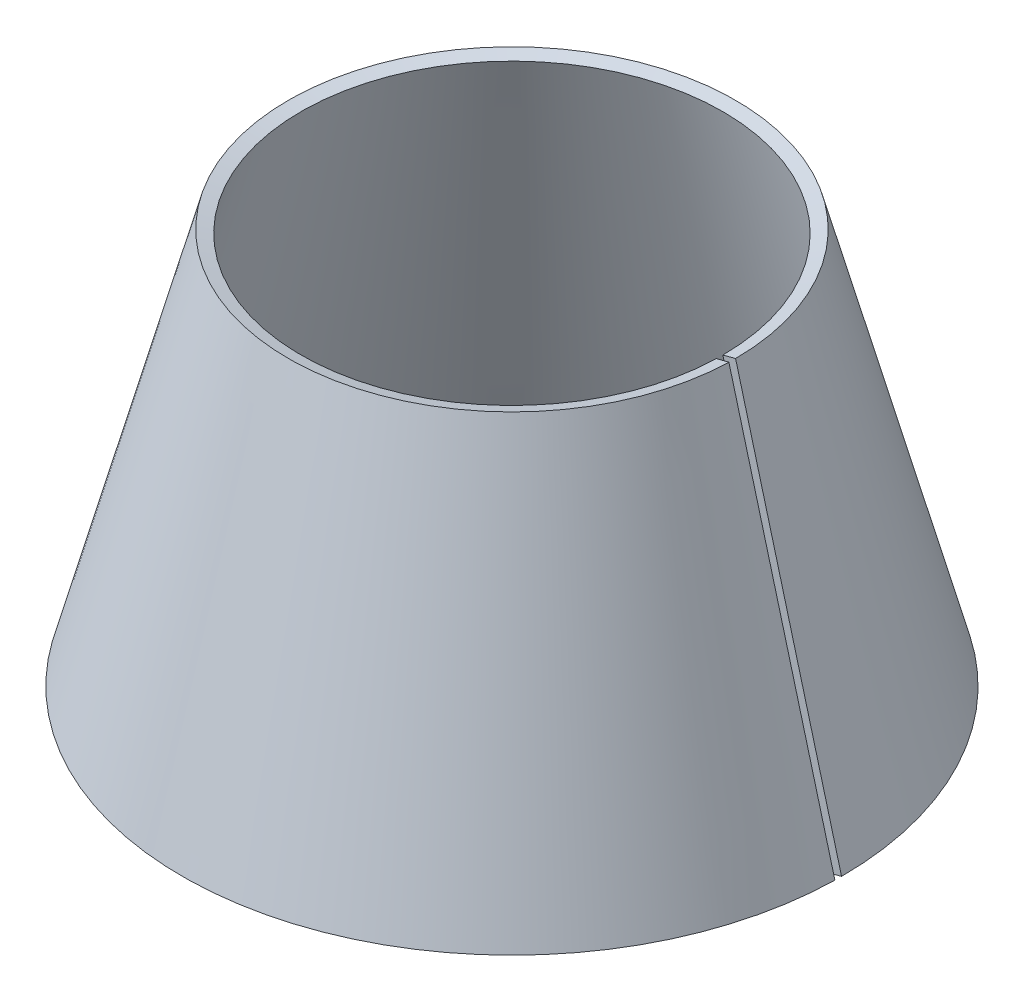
ISO-10303-21;
HEADER;
FILE_DESCRIPTION(('STEP AP214'),'2;1');
FILE_NAME('part.step','',(''),(''),'','','');
FILE_SCHEMA(('AUTOMOTIVE_DESIGN { 1 0 10303 214 1 1 1 1 }'));
ENDSEC;
DATA;
#1=APPLICATION_CONTEXT('core data for automotive mechanical design processes');
#2=APPLICATION_PROTOCOL_DEFINITION('international standard','automotive_design',2000,#1);
#3=PRODUCT_CONTEXT('',#1,'mechanical');
#4=PRODUCT('Part','Part','',(#3));
#5=PRODUCT_RELATED_PRODUCT_CATEGORY('part','',(#4));
#6=PRODUCT_DEFINITION_FORMATION('','',#4);
#7=PRODUCT_DEFINITION_CONTEXT('part definition',#1,'design');
#8=PRODUCT_DEFINITION('design','',#6,#7);
#9=PRODUCT_DEFINITION_SHAPE('','',#8);
#10=(LENGTH_UNIT() NAMED_UNIT(*) SI_UNIT(.MILLI.,.METRE.));
#11=(NAMED_UNIT(*) PLANE_ANGLE_UNIT() SI_UNIT($,.RADIAN.));
#12=(NAMED_UNIT(*) SI_UNIT($,.STERADIAN.) SOLID_ANGLE_UNIT());
#13=UNCERTAINTY_MEASURE_WITH_UNIT(LENGTH_MEASURE(1.E-05),#10,'distance_accuracy_value','');
#14=(GEOMETRIC_REPRESENTATION_CONTEXT(3) GLOBAL_UNCERTAINTY_ASSIGNED_CONTEXT((#13)) GLOBAL_UNIT_ASSIGNED_CONTEXT((#10,
#11,#12)) REPRESENTATION_CONTEXT('',''));
#15=CARTESIAN_POINT('',(0.,0.,0.));
#16=DIRECTION('',(0.,0.,1.));
#17=DIRECTION('',(1.,0.,0.));
#18=AXIS2_PLACEMENT_3D('',#15,#16,#17);
#19=CARTESIAN_POINT('',(0.,-0.258819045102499,0.));
#20=DIRECTION('',(0.,1.,0.));
#21=DIRECTION('',(0.,0.,1.));
#22=AXIS2_PLACEMENT_3D('',#19,#20,#21);
#23=CONICAL_SURFACE('',#22,49.0340741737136,1.30899693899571);
#24=DIRECTION('',(0.965925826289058,0.258819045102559,0.));
#25=VECTOR('',#24,1.);
#26=CARTESIAN_POINT('',(49.0340741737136,-0.258819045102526,0.));
#27=LINE('',#26,#25);
#28=CARTESIAN_POINT('',(48.0681483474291,-0.51763809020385,0.));
#29=VERTEX_POINT('',#28);
#30=CARTESIAN_POINT('',(50.0000000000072,1.26835391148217E-12,0.));
#31=VERTEX_POINT('',#30);
#32=EDGE_CURVE('E14',#29,#31,#27,.T.);
#33=ORIENTED_EDGE('',*,*,#32,.F.);
#34=CARTESIAN_POINT('',(0.,-0.517638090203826,0.));
#35=DIRECTION('',(0.,1.,0.));
#36=DIRECTION('',(1.,0.,0.));
#37=AXIS2_PLACEMENT_3D('',#34,#35,#36);
#38=CIRCLE('',#37,48.0681483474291);
#39=CARTESIAN_POINT('',(48.0585337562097,-0.517638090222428,0.961362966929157));
#40=VERTEX_POINT('',#39);
#41=EDGE_CURVE('E459',#29,#40,#38,.T.);
#42=ORIENTED_EDGE('',*,*,#41,.T.);
#43=CARTESIAN_POINT('',(49.9899989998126,-1.77030699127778E-11,0.999999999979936));
#44=CARTESIAN_POINT('',(48.0585337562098,-0.517638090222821,0.961362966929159));
#45=B_SPLINE_CURVE_WITH_KNOTS('',1,(#43,#44),.UNSPECIFIED.,.F.,.F.,(2,2),(0.,1.),.UNSPECIFIED.);
#46=CARTESIAN_POINT('',(49.989998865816,4.99982277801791E-07,0.999999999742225));
#47=VERTEX_POINT('',#46);
#48=EDGE_CURVE('E420',#40,#47,#45,.F.);
#49=ORIENTED_EDGE('',*,*,#48,.T.);
#50=CARTESIAN_POINT('',(0.,1.11022302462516E-12,0.));
#51=DIRECTION('',(0.,1.,0.));
#52=DIRECTION('',(1.,0.,0.));
#53=AXIS2_PLACEMENT_3D('',#50,#51,#52);
#54=CIRCLE('',#53,50.0000000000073);
#55=EDGE_CURVE('E463',#31,#47,#54,.T.);
#56=ORIENTED_EDGE('',*,*,#55,.F.);
#57=EDGE_LOOP('',(#33,#42,#49,#56));
#58=FACE_BOUND('',#57,.T.);
#59=ADVANCED_FACE('F410',(#58),#23,.T.);
#60=CARTESIAN_POINT('',(33.9083060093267,59.9999999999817,0.999999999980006));
#61=CARTESIAN_POINT('',(34.5690147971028,57.5355046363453,0.997892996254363));
#62=CARTESIAN_POINT('',(35.2344505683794,55.0532682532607,0.996061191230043));
#63=CARTESIAN_POINT('',(36.239692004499,51.3033021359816,0.99405790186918));
#64=CARTESIAN_POINT('',(36.575953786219,50.0488781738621,0.993514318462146));
#65=CARTESIAN_POINT('',(37.0821181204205,48.1605893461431,0.992927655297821));
#66=CARTESIAN_POINT('',(37.2511348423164,47.5300509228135,0.992770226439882));
#67=CARTESIAN_POINT('',(37.5051028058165,46.5825800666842,0.992596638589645));
#68=CARTESIAN_POINT('',(37.5898326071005,46.2664792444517,0.992549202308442));
#69=CARTESIAN_POINT('',(37.7170380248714,45.7919122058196,0.992494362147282));
#70=CARTESIAN_POINT('',(37.7594582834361,45.6336538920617,0.992478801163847));
#71=CARTESIAN_POINT('',(37.8231163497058,45.3961624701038,0.992459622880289));
#72=CARTESIAN_POINT('',(37.8443403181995,45.3169813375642,0.992453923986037));
#73=CARTESIAN_POINT('',(37.8761831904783,45.1981836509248,0.99244642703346));
#74=CARTESIAN_POINT('',(37.8867986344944,45.1585800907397,0.992444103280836));
#75=CARTESIAN_POINT('',(37.9027235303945,45.0991682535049,0.992440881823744));
#76=CARTESIAN_POINT('',(37.9080321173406,45.0793632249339,0.99243985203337));
#77=CARTESIAN_POINT('',(37.9159954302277,45.0496540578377,0.992438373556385));
#78=CARTESIAN_POINT('',(37.9186499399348,45.0397507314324,0.992437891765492));
#79=CARTESIAN_POINT('',(37.9239591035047,45.0199435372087,0.992436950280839));
#80=CARTESIAN_POINT('',(37.9270985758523,45.0082309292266,0.992436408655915));
#81=CARTESIAN_POINT('',(38.484764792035,42.9277135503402,0.992342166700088));
#82=CARTESIAN_POINT('',(39.1405077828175,40.4811600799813,0.993302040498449));
#83=CARTESIAN_POINT('',(39.9910053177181,37.3078894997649,0.994987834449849));
#84=CARTESIAN_POINT('',(40.0870715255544,36.949458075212,0.99518344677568));
#85=CARTESIAN_POINT('',(40.1969083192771,36.5396461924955,0.995411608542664));
#86=CARTESIAN_POINT('',(40.2091368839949,36.4940201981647,0.995437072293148));
#87=CARTESIAN_POINT('',(40.2229215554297,36.4425881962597,0.995465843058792));
#88=CARTESIAN_POINT('',(40.2244535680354,36.4368721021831,0.995469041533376));
#89=CARTESIAN_POINT('',(40.2275183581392,36.4254370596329,0.995475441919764));
#90=CARTESIAN_POINT('',(40.2278837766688,36.424073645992,0.99547620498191));
#91=CARTESIAN_POINT('',(40.2302580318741,36.4152150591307,0.995481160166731));
#92=CARTESIAN_POINT('',(40.2318456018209,36.4092916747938,0.995484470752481));
#93=CARTESIAN_POINT('',(40.2366225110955,36.3914685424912,0.995494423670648));
#94=CARTESIAN_POINT('',(40.2398260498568,36.3795158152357,0.995501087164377));
#95=CARTESIAN_POINT('',(40.2559384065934,36.3193989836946,0.99553454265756));
#96=CARTESIAN_POINT('',(40.2691312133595,36.2701752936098,0.995561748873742));
#97=CARTESIAN_POINT('',(40.3096183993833,36.1191135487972,0.995644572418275));
#98=CARTESIAN_POINT('',(40.3378215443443,36.0138848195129,0.995701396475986));
#99=CARTESIAN_POINT('',(40.4848957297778,35.4651366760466,0.995991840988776));
#100=CARTESIAN_POINT('',(40.6219421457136,34.9538037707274,0.996245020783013));
#101=CARTESIAN_POINT('',(40.9348097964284,33.7864691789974,0.996739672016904));
#102=CARTESIAN_POINT('',(41.1106310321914,33.1304674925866,0.996981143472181));
#103=CARTESIAN_POINT('',(41.4034446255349,32.0379633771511,0.997283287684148));
#104=CARTESIAN_POINT('',(41.5058961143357,31.6557117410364,0.997373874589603));
#105=CARTESIAN_POINT('',(41.6668438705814,31.0552088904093,0.997487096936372));
#106=CARTESIAN_POINT('',(41.7217048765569,30.8505203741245,0.997521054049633));
#107=CARTESIAN_POINT('',(41.8058140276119,30.5367062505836,0.997565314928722));
#108=CARTESIAN_POINT('',(41.8341533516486,30.4309713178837,0.997578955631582));
#109=CARTESIAN_POINT('',(41.8771167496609,30.2706735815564,0.997597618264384));
#110=CARTESIAN_POINT('',(41.891513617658,30.2169584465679,0.997603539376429));
#111=CARTESIAN_POINT('',(41.9132225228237,30.1359619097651,0.997611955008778));
#112=CARTESIAN_POINT('',(41.9204777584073,30.108892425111,0.997614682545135));
#113=CARTESIAN_POINT('',(41.9313890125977,30.0681822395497,0.997618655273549));
#114=CARTESIAN_POINT('',(41.935030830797,30.0545945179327,0.997619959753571));
#115=CARTESIAN_POINT('',(41.9405006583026,30.0341864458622,0.997621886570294));
#116=CARTESIAN_POINT('',(41.9423251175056,30.0273793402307,0.997622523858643));
#117=CARTESIAN_POINT('',(41.9459764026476,30.013756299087,0.997623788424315));
#118=CARTESIAN_POINT('',(41.9483223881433,30.0050033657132,0.99762459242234));
#119=CARTESIAN_POINT('',(42.284696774,28.7499817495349,0.997739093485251));
#120=CARTESIAN_POINT('',(42.6197465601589,27.4999124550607,0.997645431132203));
#121=CARTESIAN_POINT('',(43.1222973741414,25.6249119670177,0.997191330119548));
#122=CARTESIAN_POINT('',(43.2898103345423,24.9999290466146,0.996987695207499));
#123=CARTESIAN_POINT('',(43.5410737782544,24.0624805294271,0.996603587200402));
#124=CARTESIAN_POINT('',(43.6248272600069,23.7500020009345,0.99646244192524));
#125=CARTESIAN_POINT('',(43.7504559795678,23.2812906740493,0.99623102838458));
#126=CARTESIAN_POINT('',(43.7923319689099,23.1250546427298,0.996150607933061));
#127=CARTESIAN_POINT('',(43.8551455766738,22.8907022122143,0.996025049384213));
#128=CARTESIAN_POINT('',(43.8760833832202,22.8125850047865,0.995982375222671));
#129=CARTESIAN_POINT('',(43.9074899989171,22.6954095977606,0.9959171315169));
#130=CARTESIAN_POINT('',(43.9179588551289,22.6563511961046,0.995895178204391));
#131=CARTESIAN_POINT('',(43.9336621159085,22.5977636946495,0.995861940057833));
#132=CARTESIAN_POINT('',(43.9388965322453,22.5782345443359,0.995850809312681));
#133=CARTESIAN_POINT('',(43.946748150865,22.5489408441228,0.995834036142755));
#134=CARTESIAN_POINT('',(43.9493653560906,22.539176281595,0.995828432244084));
#135=CARTESIAN_POINT('',(43.9545997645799,22.5196471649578,0.995817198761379));
#136=CARTESIAN_POINT('',(43.9577874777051,22.507754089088,0.99581033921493));
#137=CARTESIAN_POINT('',(44.2218108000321,21.5227064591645,0.995241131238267));
#138=CARTESIAN_POINT('',(44.5203096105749,20.4089990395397,0.994946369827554));
#139=CARTESIAN_POINT('',(45.0228426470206,18.5339941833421,0.994790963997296));
#140=CARTESIAN_POINT('',(45.1994844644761,17.8749186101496,0.994786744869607));
#141=CARTESIAN_POINT('',(45.478143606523,16.8351943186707,0.994835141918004));
#142=CARTESIAN_POINT('',(45.5733127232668,16.4801010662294,0.994860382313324));
#143=CARTESIAN_POINT('',(45.7194905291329,15.934683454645,0.994909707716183));
#144=CARTESIAN_POINT('',(45.7687871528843,15.7507479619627,0.994928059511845));
#145=CARTESIAN_POINT('',(45.8435881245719,15.4716502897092,0.994958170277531));
#146=CARTESIAN_POINT('',(45.868664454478,15.3780853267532,0.994968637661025));
#147=CARTESIAN_POINT('',(45.9064929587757,15.2369392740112,0.994984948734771));
#148=CARTESIAN_POINT('',(45.919138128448,15.1897574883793,0.994990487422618));
#149=CARTESIAN_POINT('',(45.9381593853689,15.1187851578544,0.994998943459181));
#150=CARTESIAN_POINT('',(45.9445087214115,15.0950944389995,0.995001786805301));
#151=CARTESIAN_POINT('',(45.9540461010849,15.0595084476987,0.995006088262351));
#152=CARTESIAN_POINT('',(45.9572274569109,15.047638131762,0.99500752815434));
#153=CARTESIAN_POINT('',(45.9620028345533,15.0298201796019,0.995009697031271));
#154=CARTESIAN_POINT('',(45.963595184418,15.0238787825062,0.995010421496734));
#155=CARTESIAN_POINT('',(45.9667809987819,15.0119918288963,0.995011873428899));
#156=CARTESIAN_POINT('',(45.9687854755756,15.0045126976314,0.995012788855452));
#157=CARTESIAN_POINT('',(47.1813702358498,10.4800996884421,0.995567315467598));
#158=CARTESIAN_POINT('',(48.5213778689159,5.48006682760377,0.99739481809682));
#159=CARTESIAN_POINT('',(49.9899989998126,-1.77030699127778E-11,0.999999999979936));
#160=CARTESIAN_POINT('',(31.977293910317,59.4823619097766,0.943051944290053));
#161=CARTESIAN_POINT('',(32.6379664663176,57.0178665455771,0.942173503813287));
#162=CARTESIAN_POINT('',(33.303369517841,54.5356301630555,0.941490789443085));
#163=CARTESIAN_POINT('',(34.3085665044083,50.7856640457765,0.941091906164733));
#164=CARTESIAN_POINT('',(34.6448142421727,49.531240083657,0.941063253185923));
#165=CARTESIAN_POINT('',(35.150958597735,47.642951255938,0.941219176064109));
#166=CARTESIAN_POINT('',(35.3199688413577,47.0124128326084,0.941304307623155));
#167=CARTESIAN_POINT('',(35.5739273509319,46.064941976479,0.941487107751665));
#168=CARTESIAN_POINT('',(35.6586540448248,45.7488411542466,0.941557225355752));
#169=CARTESIAN_POINT('',(35.7858548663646,45.2742741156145,0.941676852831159));
#170=CARTESIAN_POINT('',(35.8282736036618,45.1160158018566,0.941719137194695));
#171=CARTESIAN_POINT('',(35.8919294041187,44.8785243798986,0.941786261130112));
#172=CARTESIAN_POINT('',(35.913152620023,44.7993432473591,0.941809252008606));
#173=CARTESIAN_POINT('',(35.9449943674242,44.6805455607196,0.941844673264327));
#174=CARTESIAN_POINT('',(35.9556094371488,44.6409420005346,0.941856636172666));
#175=CARTESIAN_POINT('',(35.9715337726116,44.5815301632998,0.941874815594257));
#176=CARTESIAN_POINT('',(35.9768421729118,44.5617251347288,0.941880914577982));
#177=CARTESIAN_POINT('',(35.9848052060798,44.5320159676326,0.941890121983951));
#178=CARTESIAN_POINT('',(35.9874596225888,44.5221126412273,0.94189320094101));
#179=CARTESIAN_POINT('',(35.9927685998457,44.5023054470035,0.941899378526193));
#180=CARTESIAN_POINT('',(35.9959079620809,44.4905928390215,0.941903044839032));
#181=CARTESIAN_POINT('',(36.5535546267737,42.410075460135,0.942556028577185));
#182=CARTESIAN_POINT('',(37.2092773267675,39.9635219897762,0.944307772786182));
#183=CARTESIAN_POINT('',(38.0597513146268,36.7902514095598,0.946937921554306));
#184=CARTESIAN_POINT('',(38.1558148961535,36.4318199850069,0.947239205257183));
#185=CARTESIAN_POINT('',(38.2656487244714,36.0220081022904,0.947587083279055));
#186=CARTESIAN_POINT('',(38.2778769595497,35.9763821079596,0.947625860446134));
#187=CARTESIAN_POINT('',(38.291661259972,35.9249501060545,0.947669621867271));
#188=CARTESIAN_POINT('',(38.2931932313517,35.919234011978,0.947674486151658));
#189=CARTESIAN_POINT('',(38.296257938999,35.9077989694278,0.947684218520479));
#190=CARTESIAN_POINT('',(38.2966233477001,35.9064355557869,0.947685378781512));
#191=CARTESIAN_POINT('',(38.298997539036,35.8975769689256,0.947692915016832));
#192=CARTESIAN_POINT('',(38.30058506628,35.8916535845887,0.94769795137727));
#193=CARTESIAN_POINT('',(38.3053618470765,35.8738304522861,0.947713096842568));
#194=CARTESIAN_POINT('',(38.3085652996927,35.8618777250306,0.947723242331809));
#195=CARTESIAN_POINT('',(38.3246772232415,35.8017608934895,0.947774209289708));
#196=CARTESIAN_POINT('',(38.3378696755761,35.7525372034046,0.947815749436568));
#197=CARTESIAN_POINT('',(38.3783557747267,35.6014754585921,0.947942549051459));
#198=CARTESIAN_POINT('',(38.4065581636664,35.4962467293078,0.948029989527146));
#199=CARTESIAN_POINT('',(38.5536284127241,34.9474985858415,0.948480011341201));
#200=CARTESIAN_POINT('',(38.6906711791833,34.4361656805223,0.948881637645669));
#201=CARTESIAN_POINT('',(39.0035305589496,33.2688310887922,0.9497147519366));
#202=CARTESIAN_POINT('',(39.1793471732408,32.6128294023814,0.95014623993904));
#203=CARTESIAN_POINT('',(39.4721531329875,31.520325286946,0.95076458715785));
#204=CARTESIAN_POINT('',(39.5746019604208,31.1380736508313,0.950965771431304));
#205=CARTESIAN_POINT('',(39.7355455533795,30.5375708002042,0.951252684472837));
#206=CARTESIAN_POINT('',(39.7904051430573,30.3328822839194,0.951345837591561));
#207=CARTESIAN_POINT('',(39.8745121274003,30.0190681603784,0.95148084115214));
#208=CARTESIAN_POINT('',(39.9028507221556,29.9133332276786,0.951525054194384));
#209=CARTESIAN_POINT('',(39.9458130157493,29.7530354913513,0.951590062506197));
#210=CARTESIAN_POINT('',(39.9602095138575,29.6993203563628,0.951611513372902));
#211=CARTESIAN_POINT('',(39.9819178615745,29.6183238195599,0.951643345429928));
#212=CARTESIAN_POINT('',(39.9891729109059,29.5912543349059,0.951653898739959));
#213=CARTESIAN_POINT('',(40.0000838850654,29.5505441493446,0.951669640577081));
#214=CARTESIAN_POINT('',(40.0037256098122,29.5369564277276,0.951674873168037));
#215=CARTESIAN_POINT('',(40.0091952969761,29.516548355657,0.951682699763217));
#216=CARTESIAN_POINT('',(40.0110197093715,29.5097412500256,0.95168530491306));
#217=CARTESIAN_POINT('',(40.0146709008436,29.4961182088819,0.951690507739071));
#218=CARTESIAN_POINT('',(40.0170168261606,29.4873652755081,0.951693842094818));
#219=CARTESIAN_POINT('',(40.3533825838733,28.2323436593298,0.952171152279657));
#220=CARTESIAN_POINT('',(40.6884238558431,26.9822743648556,0.952439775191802));
#221=CARTESIAN_POINT('',(41.1909620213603,25.1072738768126,0.952530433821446));
#222=CARTESIAN_POINT('',(41.3584707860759,24.4822909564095,0.952508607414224));
#223=CARTESIAN_POINT('',(41.6097279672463,23.544842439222,0.952397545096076));
#224=CARTESIAN_POINT('',(41.6934793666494,23.2323639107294,0.952347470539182));
#225=CARTESIAN_POINT('',(41.8191049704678,22.7636525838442,0.952252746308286));
#226=CARTESIAN_POINT('',(41.8609799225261,22.6074165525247,0.952217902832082));
#227=CARTESIAN_POINT('',(41.9237919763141,22.3730641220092,0.952160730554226));
#228=CARTESIAN_POINT('',(41.9447292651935,22.2949469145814,0.952140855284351));
#229=CARTESIAN_POINT('',(41.976135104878,22.1777715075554,0.952109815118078));
#230=CARTESIAN_POINT('',(41.9866037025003,22.1387131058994,0.952099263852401));
#231=CARTESIAN_POINT('',(42.0023065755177,22.0801256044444,0.952083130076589));
#232=CARTESIAN_POINT('',(42.0075408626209,22.0605964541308,0.952077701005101));
#233=CARTESIAN_POINT('',(42.0153922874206,22.0313027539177,0.952069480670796));
#234=CARTESIAN_POINT('',(42.0180094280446,22.0215381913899,0.95206672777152));
#235=CARTESIAN_POINT('',(42.0232437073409,22.0020090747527,0.952061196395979));
#236=CARTESIAN_POINT('',(42.0264313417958,21.9901159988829,0.952057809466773));
#237=CARTESIAN_POINT('',(42.2904481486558,21.0050683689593,0.951776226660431));
#238=CARTESIAN_POINT('',(42.5889401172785,19.8913609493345,0.951786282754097));
#239=CARTESIAN_POINT('',(43.0914623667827,18.016356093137,0.952117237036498));
#240=CARTESIAN_POINT('',(43.2681005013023,17.3572805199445,0.95227999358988));
#241=CARTESIAN_POINT('',(43.5467539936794,16.3175562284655,0.952586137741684));
#242=CARTESIAN_POINT('',(43.6419212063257,15.9624629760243,0.952698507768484));
#243=CARTESIAN_POINT('',(43.7880961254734,15.4170453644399,0.952880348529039));
#244=CARTESIAN_POINT('',(43.8373917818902,15.2331098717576,0.952943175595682));
#245=CARTESIAN_POINT('',(43.9121912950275,14.9540121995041,0.953040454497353));
#246=CARTESIAN_POINT('',(43.9372671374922,14.8604472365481,0.953073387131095));
#247=CARTESIAN_POINT('',(43.9750949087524,14.7193011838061,0.95312350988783));
#248=CARTESIAN_POINT('',(43.9877398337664,14.6721193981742,0.95314033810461));
#249=CARTESIAN_POINT('',(44.0067607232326,14.6011470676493,0.953165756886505));
#250=CARTESIAN_POINT('',(44.0131099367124,14.5774563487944,0.953174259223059));
#251=CARTESIAN_POINT('',(44.0226471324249,14.5418703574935,0.953187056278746));
#252=CARTESIAN_POINT('',(44.0258284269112,14.5300000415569,0.953191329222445));
#253=CARTESIAN_POINT('',(44.0306037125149,14.5121820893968,0.953197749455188));
#254=CARTESIAN_POINT('',(44.0321960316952,14.5062406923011,0.95319989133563));
#255=CARTESIAN_POINT('',(44.0353817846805,14.4943537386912,0.953204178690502));
#256=CARTESIAN_POINT('',(44.0373862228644,14.4868746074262,0.953206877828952));
#257=CARTESIAN_POINT('',(45.2499476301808,9.96246159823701,0.954840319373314));
#258=CARTESIAN_POINT('',(46.589933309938,4.96242873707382,0.957723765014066));
#259=CARTESIAN_POINT('',(48.0585337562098,-0.517638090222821,0.961362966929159));
#260=B_SPLINE_SURFACE_WITH_KNOTS('',1,3,((#60,#61,#62,#63,#64,#65,#66,#67,#68,#69,#70,#71,#72,
#73,#74,#75,#76,#77,#78,#79,#80,#81,#82,#83,#84,#85,#86,#87,#88,#89,#90,#91,#92,#93,#94,#95,#96,
#97,#98,#99,#100,#101,#102,#103,#104,#105,#106,#107,#108,#109,#110,#111,#112,#113,#114,#115,
#116,#117,#118,#119,#120,#121,#122,#123,#124,#125,#126,#127,#128,#129,#130,#131,#132,#133,#134,
#135,#136,#137,#138,#139,#140,#141,#142,#143,#144,#145,#146,#147,#148,#149,#150,#151,#152,#153,
#154,#155,#156,#157,#158,#159),(#160,#161,#162,#163,#164,#165,#166,#167,#168,#169,#170,#171,
#172,#173,#174,#175,#176,#177,#178,#179,#180,#181,#182,#183,#184,#185,#186,#187,#188,#189,#190,
#191,#192,#193,#194,#195,#196,#197,#198,#199,#200,#201,#202,#203,#204,#205,#206,#207,#208,#209,
#210,#211,#212,#213,#214,#215,#216,#217,#218,#219,#220,#221,#222,#223,#224,#225,#226,#227,#228,
#229,#230,#231,#232,#233,#234,#235,#236,#237,#238,#239,#240,#241,#242,#243,#244,#245,#246,#247,
#248,#249,#250,#251,#252,#253,#254,#255,#256,#257,#258,#259)),.UNSPECIFIED.,.F.,.F.,.F.,(2,2),
(4,2,2,2,2,2,2,2,2,2,2,2,2,2,2,2,2,2,2,2,2,2,2,2,2,2,2,2,2,2,2,2,2,2,2,2,2,2,2,2,2,2,2,2,2,2,2,
2,2,4),(0.,1.),(0.,0.125,0.1875,0.21875,0.234375,0.2421875,0.24609375,0.248046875,0.2490234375,
0.24951171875,0.25,0.375,0.390625,0.392578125,0.392822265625,0.39306640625,0.3935546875,
0.39453125,0.3984375,0.40625,0.4375,0.46875,0.484375,0.4921875,0.49609375,0.498046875,
0.4990234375,0.49951171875,0.499755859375,0.5,0.5625,0.59375,0.609375,0.6171875,0.62109375,
0.623046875,0.6240234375,0.62451171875,0.625,0.6875,0.71875,0.734375,0.7421875,0.74609375,
0.748046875,0.7490234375,0.74951171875,0.749755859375,0.75,1.),.UNSPECIFIED.);
#261=CARTESIAN_POINT('',(48.0585337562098,-0.517638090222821,0.961362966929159));
#262=CARTESIAN_POINT('',(46.589933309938,4.96242873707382,0.957723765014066));
#263=CARTESIAN_POINT('',(45.2499476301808,9.96246159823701,0.954840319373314));
#264=CARTESIAN_POINT('',(44.0373862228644,14.4868746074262,0.953206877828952));
#265=CARTESIAN_POINT('',(44.0353817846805,14.4943537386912,0.953204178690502));
#266=CARTESIAN_POINT('',(44.0321960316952,14.5062406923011,0.95319989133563));
#267=CARTESIAN_POINT('',(44.0306037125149,14.5121820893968,0.953197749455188));
#268=CARTESIAN_POINT('',(44.0258284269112,14.5300000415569,0.953191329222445));
#269=CARTESIAN_POINT('',(44.0226471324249,14.5418703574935,0.953187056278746));
#270=CARTESIAN_POINT('',(44.0131099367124,14.5774563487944,0.953174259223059));
#271=CARTESIAN_POINT('',(44.0067607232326,14.6011470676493,0.953165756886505));
#272=CARTESIAN_POINT('',(43.9877398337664,14.6721193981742,0.95314033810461));
#273=CARTESIAN_POINT('',(43.9750949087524,14.7193011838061,0.95312350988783));
#274=CARTESIAN_POINT('',(43.9372671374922,14.8604472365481,0.953073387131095));
#275=CARTESIAN_POINT('',(43.9121912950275,14.9540121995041,0.953040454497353));
#276=CARTESIAN_POINT('',(43.8373917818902,15.2331098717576,0.952943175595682));
#277=CARTESIAN_POINT('',(43.7880961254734,15.4170453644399,0.952880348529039));
#278=CARTESIAN_POINT('',(43.6419212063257,15.9624629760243,0.952698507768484));
#279=CARTESIAN_POINT('',(43.5467539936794,16.3175562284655,0.952586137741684));
#280=CARTESIAN_POINT('',(43.2681005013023,17.3572805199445,0.95227999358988));
#281=CARTESIAN_POINT('',(43.0914623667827,18.016356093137,0.952117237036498));
#282=CARTESIAN_POINT('',(42.5889401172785,19.8913609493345,0.951786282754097));
#283=CARTESIAN_POINT('',(42.2904481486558,21.0050683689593,0.951776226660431));
#284=CARTESIAN_POINT('',(42.0264313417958,21.9901159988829,0.952057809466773));
#285=CARTESIAN_POINT('',(42.0232437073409,22.0020090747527,0.952061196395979));
#286=CARTESIAN_POINT('',(42.0180094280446,22.0215381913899,0.95206672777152));
#287=CARTESIAN_POINT('',(42.0153922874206,22.0313027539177,0.952069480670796));
#288=CARTESIAN_POINT('',(42.0075408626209,22.0605964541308,0.952077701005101));
#289=CARTESIAN_POINT('',(42.0023065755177,22.0801256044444,0.952083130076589));
#290=CARTESIAN_POINT('',(41.9866037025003,22.1387131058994,0.952099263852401));
#291=CARTESIAN_POINT('',(41.976135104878,22.1777715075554,0.952109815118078));
#292=CARTESIAN_POINT('',(41.9447292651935,22.2949469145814,0.952140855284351));
#293=CARTESIAN_POINT('',(41.9237919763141,22.3730641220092,0.952160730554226));
#294=CARTESIAN_POINT('',(41.8609799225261,22.6074165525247,0.952217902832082));
#295=CARTESIAN_POINT('',(41.8191049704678,22.7636525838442,0.952252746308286));
#296=CARTESIAN_POINT('',(41.6934793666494,23.2323639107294,0.952347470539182));
#297=CARTESIAN_POINT('',(41.6097279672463,23.544842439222,0.952397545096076));
#298=CARTESIAN_POINT('',(41.3584707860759,24.4822909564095,0.952508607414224));
#299=CARTESIAN_POINT('',(41.1909620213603,25.1072738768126,0.952530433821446));
#300=CARTESIAN_POINT('',(40.6884238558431,26.9822743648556,0.952439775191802));
#301=CARTESIAN_POINT('',(40.3533825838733,28.2323436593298,0.952171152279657));
#302=CARTESIAN_POINT('',(40.0170168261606,29.4873652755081,0.951693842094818));
#303=CARTESIAN_POINT('',(40.0146709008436,29.4961182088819,0.951690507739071));
#304=CARTESIAN_POINT('',(40.0110197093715,29.5097412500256,0.95168530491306));
#305=CARTESIAN_POINT('',(40.0091952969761,29.516548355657,0.951682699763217));
#306=CARTESIAN_POINT('',(40.0037256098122,29.5369564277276,0.951674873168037));
#307=CARTESIAN_POINT('',(40.0000838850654,29.5505441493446,0.951669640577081));
#308=CARTESIAN_POINT('',(39.9891729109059,29.5912543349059,0.951653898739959));
#309=CARTESIAN_POINT('',(39.9819178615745,29.6183238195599,0.951643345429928));
#310=CARTESIAN_POINT('',(39.9602095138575,29.6993203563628,0.951611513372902));
#311=CARTESIAN_POINT('',(39.9458130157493,29.7530354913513,0.951590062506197));
#312=CARTESIAN_POINT('',(39.9028507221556,29.9133332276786,0.951525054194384));
#313=CARTESIAN_POINT('',(39.8745121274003,30.0190681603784,0.95148084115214));
#314=CARTESIAN_POINT('',(39.7904051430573,30.3328822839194,0.951345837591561));
#315=CARTESIAN_POINT('',(39.7355455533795,30.5375708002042,0.951252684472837));
#316=CARTESIAN_POINT('',(39.5746019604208,31.1380736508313,0.950965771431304));
#317=CARTESIAN_POINT('',(39.4721531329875,31.520325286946,0.95076458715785));
#318=CARTESIAN_POINT('',(39.1793471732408,32.6128294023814,0.95014623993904));
#319=CARTESIAN_POINT('',(39.0035305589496,33.2688310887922,0.9497147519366));
#320=CARTESIAN_POINT('',(38.6906711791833,34.4361656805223,0.948881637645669));
#321=CARTESIAN_POINT('',(38.5536284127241,34.9474985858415,0.948480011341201));
#322=CARTESIAN_POINT('',(38.4065581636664,35.4962467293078,0.948029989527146));
#323=CARTESIAN_POINT('',(38.3783557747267,35.6014754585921,0.947942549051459));
#324=CARTESIAN_POINT('',(38.3378696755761,35.7525372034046,0.947815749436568));
#325=CARTESIAN_POINT('',(38.3246772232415,35.8017608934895,0.947774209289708));
#326=CARTESIAN_POINT('',(38.3085652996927,35.8618777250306,0.947723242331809));
#327=CARTESIAN_POINT('',(38.3053618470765,35.8738304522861,0.947713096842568));
#328=CARTESIAN_POINT('',(38.30058506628,35.8916535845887,0.94769795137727));
#329=CARTESIAN_POINT('',(38.298997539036,35.8975769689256,0.947692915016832));
#330=CARTESIAN_POINT('',(38.2966233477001,35.9064355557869,0.947685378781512));
#331=CARTESIAN_POINT('',(38.296257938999,35.9077989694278,0.947684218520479));
#332=CARTESIAN_POINT('',(38.2931932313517,35.919234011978,0.947674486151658));
#333=CARTESIAN_POINT('',(38.291661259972,35.9249501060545,0.947669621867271));
#334=CARTESIAN_POINT('',(38.2778769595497,35.9763821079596,0.947625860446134));
#335=CARTESIAN_POINT('',(38.2656487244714,36.0220081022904,0.947587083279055));
#336=CARTESIAN_POINT('',(38.1558148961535,36.4318199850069,0.947239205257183));
#337=CARTESIAN_POINT('',(38.0597513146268,36.7902514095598,0.946937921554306));
#338=CARTESIAN_POINT('',(37.2092773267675,39.9635219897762,0.944307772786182));
#339=CARTESIAN_POINT('',(36.5535546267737,42.410075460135,0.942556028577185));
#340=CARTESIAN_POINT('',(35.9959079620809,44.4905928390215,0.941903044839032));
#341=CARTESIAN_POINT('',(35.9927685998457,44.5023054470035,0.941899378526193));
#342=CARTESIAN_POINT('',(35.9874596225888,44.5221126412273,0.94189320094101));
#343=CARTESIAN_POINT('',(35.9848052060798,44.5320159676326,0.941890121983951));
#344=CARTESIAN_POINT('',(35.9768421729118,44.5617251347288,0.941880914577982));
#345=CARTESIAN_POINT('',(35.9715337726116,44.5815301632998,0.941874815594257));
#346=CARTESIAN_POINT('',(35.9556094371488,44.6409420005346,0.941856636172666));
#347=CARTESIAN_POINT('',(35.9449943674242,44.6805455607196,0.941844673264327));
#348=CARTESIAN_POINT('',(35.913152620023,44.7993432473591,0.941809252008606));
#349=CARTESIAN_POINT('',(35.8919294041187,44.8785243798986,0.941786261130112));
#350=CARTESIAN_POINT('',(35.8282736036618,45.1160158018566,0.941719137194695));
#351=CARTESIAN_POINT('',(35.7858548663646,45.2742741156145,0.941676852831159));
#352=CARTESIAN_POINT('',(35.6586540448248,45.7488411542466,0.941557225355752));
#353=CARTESIAN_POINT('',(35.5739273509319,46.064941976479,0.941487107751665));
#354=CARTESIAN_POINT('',(35.3199688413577,47.0124128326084,0.941304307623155));
#355=CARTESIAN_POINT('',(35.150958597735,47.642951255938,0.941219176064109));
#356=CARTESIAN_POINT('',(34.6448142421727,49.531240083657,0.941063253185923));
#357=CARTESIAN_POINT('',(34.3085665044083,50.7856640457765,0.941091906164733));
#358=CARTESIAN_POINT('',(33.303369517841,54.5356301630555,0.941490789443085));
#359=CARTESIAN_POINT('',(32.6379664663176,57.0178665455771,0.942173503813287));
#360=CARTESIAN_POINT('',(31.977293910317,59.4823619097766,0.943051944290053));
#361=B_SPLINE_CURVE_WITH_KNOTS('',3,(#261,#262,#263,#264,#265,#266,#267,#268,#269,#270,#271,
#272,#273,#274,#275,#276,#277,#278,#279,#280,#281,#282,#283,#284,#285,#286,#287,#288,#289,#290,
#291,#292,#293,#294,#295,#296,#297,#298,#299,#300,#301,#302,#303,#304,#305,#306,#307,#308,#309,
#310,#311,#312,#313,#314,#315,#316,#317,#318,#319,#320,#321,#322,#323,#324,#325,#326,#327,#328,
#329,#330,#331,#332,#333,#334,#335,#336,#337,#338,#339,#340,#341,#342,#343,#344,#345,#346,#347,
#348,#349,#350,#351,#352,#353,#354,#355,#356,#357,#358,#359,#360),.UNSPECIFIED.,.F.,.F.,(4,2,2,
2,2,2,2,2,2,2,2,2,2,2,2,2,2,2,2,2,2,2,2,2,2,2,2,2,2,2,2,2,2,2,2,2,2,2,2,2,2,2,2,2,2,2,2,2,2,4),
(0.,0.25,0.250244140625,0.25048828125,0.2509765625,0.251953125,0.25390625,0.2578125,0.265625,
0.28125,0.3125,0.375,0.37548828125,0.3759765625,0.376953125,0.37890625,0.3828125,0.390625,
0.40625,0.4375,0.5,0.500244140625,0.50048828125,0.5009765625,0.501953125,0.50390625,0.5078125,
0.515625,0.53125,0.5625,0.59375,0.6015625,0.60546875,0.6064453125,0.60693359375,0.607177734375,
0.607421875,0.609375,0.625,0.75,0.75048828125,0.7509765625,0.751953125,0.75390625,0.7578125,
0.765625,0.78125,0.8125,0.875,1.),.UNSPECIFIED.);
#362=CARTESIAN_POINT('',(31.9772939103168,59.4823619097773,0.943051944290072));
#363=VERTEX_POINT('',#362);
#364=EDGE_CURVE('E470',#363,#40,#361,.F.);
#365=CARTESIAN_POINT('',(31.977293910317,59.4823619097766,0.943051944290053));
#366=CARTESIAN_POINT('',(33.9083060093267,59.9999999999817,0.999999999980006));
#367=B_SPLINE_CURVE_WITH_KNOTS('',1,(#365,#366),.UNSPECIFIED.,.F.,.F.,(2,2),(0.,1.),.UNSPECIFIED.);
#368=CARTESIAN_POINT('',(33.9083060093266,59.9999999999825,0.999999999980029));
#369=VERTEX_POINT('',#368);
#370=EDGE_CURVE('E428',#363,#369,#367,.T.);
#371=CARTESIAN_POINT('',(33.9083060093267,59.9999999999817,0.999999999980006));
#372=CARTESIAN_POINT('',(34.5690147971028,57.5355046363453,0.997892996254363));
#373=CARTESIAN_POINT('',(35.2344505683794,55.0532682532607,0.996061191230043));
#374=CARTESIAN_POINT('',(36.239692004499,51.3033021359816,0.99405790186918));
#375=CARTESIAN_POINT('',(36.575953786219,50.0488781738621,0.993514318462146));
#376=CARTESIAN_POINT('',(37.0821181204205,48.1605893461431,0.992927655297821));
#377=CARTESIAN_POINT('',(37.2511348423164,47.5300509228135,0.992770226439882));
#378=CARTESIAN_POINT('',(37.5051028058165,46.5825800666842,0.992596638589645));
#379=CARTESIAN_POINT('',(37.5898326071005,46.2664792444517,0.992549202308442));
#380=CARTESIAN_POINT('',(37.7170380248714,45.7919122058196,0.992494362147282));
#381=CARTESIAN_POINT('',(37.7594582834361,45.6336538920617,0.992478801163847));
#382=CARTESIAN_POINT('',(37.8231163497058,45.3961624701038,0.992459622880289));
#383=CARTESIAN_POINT('',(37.8443403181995,45.3169813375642,0.992453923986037));
#384=CARTESIAN_POINT('',(37.8761831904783,45.1981836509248,0.99244642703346));
#385=CARTESIAN_POINT('',(37.8867986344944,45.1585800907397,0.992444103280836));
#386=CARTESIAN_POINT('',(37.9027235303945,45.0991682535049,0.992440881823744));
#387=CARTESIAN_POINT('',(37.9080321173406,45.0793632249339,0.99243985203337));
#388=CARTESIAN_POINT('',(37.9159954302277,45.0496540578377,0.992438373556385));
#389=CARTESIAN_POINT('',(37.9186499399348,45.0397507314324,0.992437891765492));
#390=CARTESIAN_POINT('',(37.9239591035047,45.0199435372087,0.992436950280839));
#391=CARTESIAN_POINT('',(37.9270985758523,45.0082309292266,0.992436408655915));
#392=CARTESIAN_POINT('',(38.484764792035,42.9277135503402,0.992342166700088));
#393=CARTESIAN_POINT('',(39.1405077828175,40.4811600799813,0.993302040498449));
#394=CARTESIAN_POINT('',(39.9910053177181,37.3078894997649,0.994987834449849));
#395=CARTESIAN_POINT('',(40.0870715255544,36.949458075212,0.99518344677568));
#396=CARTESIAN_POINT('',(40.1969083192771,36.5396461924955,0.995411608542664));
#397=CARTESIAN_POINT('',(40.2091368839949,36.4940201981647,0.995437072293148));
#398=CARTESIAN_POINT('',(40.2229215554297,36.4425881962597,0.995465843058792));
#399=CARTESIAN_POINT('',(40.2244535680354,36.4368721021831,0.995469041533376));
#400=CARTESIAN_POINT('',(40.2275183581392,36.4254370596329,0.995475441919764));
#401=CARTESIAN_POINT('',(40.2278837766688,36.424073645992,0.99547620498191));
#402=CARTESIAN_POINT('',(40.2302580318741,36.4152150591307,0.995481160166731));
#403=CARTESIAN_POINT('',(40.2318456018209,36.4092916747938,0.995484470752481));
#404=CARTESIAN_POINT('',(40.2366225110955,36.3914685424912,0.995494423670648));
#405=CARTESIAN_POINT('',(40.2398260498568,36.3795158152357,0.995501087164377));
#406=CARTESIAN_POINT('',(40.2559384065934,36.3193989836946,0.99553454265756));
#407=CARTESIAN_POINT('',(40.2691312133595,36.2701752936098,0.995561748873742));
#408=CARTESIAN_POINT('',(40.3096183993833,36.1191135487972,0.995644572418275));
#409=CARTESIAN_POINT('',(40.3378215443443,36.0138848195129,0.995701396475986));
#410=CARTESIAN_POINT('',(40.4848957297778,35.4651366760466,0.995991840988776));
#411=CARTESIAN_POINT('',(40.6219421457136,34.9538037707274,0.996245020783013));
#412=CARTESIAN_POINT('',(40.9348097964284,33.7864691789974,0.996739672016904));
#413=CARTESIAN_POINT('',(41.1106310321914,33.1304674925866,0.996981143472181));
#414=CARTESIAN_POINT('',(41.4034446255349,32.0379633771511,0.997283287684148));
#415=CARTESIAN_POINT('',(41.5058961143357,31.6557117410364,0.997373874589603));
#416=CARTESIAN_POINT('',(41.6668438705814,31.0552088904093,0.997487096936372));
#417=CARTESIAN_POINT('',(41.7217048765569,30.8505203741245,0.997521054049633));
#418=CARTESIAN_POINT('',(41.8058140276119,30.5367062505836,0.997565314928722));
#419=CARTESIAN_POINT('',(41.8341533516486,30.4309713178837,0.997578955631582));
#420=CARTESIAN_POINT('',(41.8771167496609,30.2706735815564,0.997597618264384));
#421=CARTESIAN_POINT('',(41.891513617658,30.2169584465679,0.997603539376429));
#422=CARTESIAN_POINT('',(41.9132225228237,30.1359619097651,0.997611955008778));
#423=CARTESIAN_POINT('',(41.9204777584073,30.108892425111,0.997614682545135));
#424=CARTESIAN_POINT('',(41.9313890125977,30.0681822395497,0.997618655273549));
#425=CARTESIAN_POINT('',(41.935030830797,30.0545945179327,0.997619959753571));
#426=CARTESIAN_POINT('',(41.9405006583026,30.0341864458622,0.997621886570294));
#427=CARTESIAN_POINT('',(41.9423251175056,30.0273793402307,0.997622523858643));
#428=CARTESIAN_POINT('',(41.9459764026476,30.013756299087,0.997623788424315));
#429=CARTESIAN_POINT('',(41.9483223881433,30.0050033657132,0.99762459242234));
#430=CARTESIAN_POINT('',(42.284696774,28.7499817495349,0.997739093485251));
#431=CARTESIAN_POINT('',(42.6197465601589,27.4999124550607,0.997645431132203));
#432=CARTESIAN_POINT('',(43.1222973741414,25.6249119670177,0.997191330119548));
#433=CARTESIAN_POINT('',(43.2898103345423,24.9999290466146,0.996987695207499));
#434=CARTESIAN_POINT('',(43.5410737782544,24.0624805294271,0.996603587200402));
#435=CARTESIAN_POINT('',(43.6248272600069,23.7500020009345,0.99646244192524));
#436=CARTESIAN_POINT('',(43.7504559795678,23.2812906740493,0.99623102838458));
#437=CARTESIAN_POINT('',(43.7923319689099,23.1250546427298,0.996150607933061));
#438=CARTESIAN_POINT('',(43.8551455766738,22.8907022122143,0.996025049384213));
#439=CARTESIAN_POINT('',(43.8760833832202,22.8125850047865,0.995982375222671));
#440=CARTESIAN_POINT('',(43.9074899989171,22.6954095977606,0.9959171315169));
#441=CARTESIAN_POINT('',(43.9179588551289,22.6563511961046,0.995895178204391));
#442=CARTESIAN_POINT('',(43.9336621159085,22.5977636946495,0.995861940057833));
#443=CARTESIAN_POINT('',(43.9388965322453,22.5782345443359,0.995850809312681));
#444=CARTESIAN_POINT('',(43.946748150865,22.5489408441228,0.995834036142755));
#445=CARTESIAN_POINT('',(43.9493653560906,22.539176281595,0.995828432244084));
#446=CARTESIAN_POINT('',(43.9545997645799,22.5196471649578,0.995817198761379));
#447=CARTESIAN_POINT('',(43.9577874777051,22.507754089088,0.99581033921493));
#448=CARTESIAN_POINT('',(44.2218108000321,21.5227064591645,0.995241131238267));
#449=CARTESIAN_POINT('',(44.5203096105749,20.4089990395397,0.994946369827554));
#450=CARTESIAN_POINT('',(45.0228426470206,18.5339941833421,0.994790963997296));
#451=CARTESIAN_POINT('',(45.1994844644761,17.8749186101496,0.994786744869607));
#452=CARTESIAN_POINT('',(45.478143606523,16.8351943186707,0.994835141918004));
#453=CARTESIAN_POINT('',(45.5733127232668,16.4801010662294,0.994860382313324));
#454=CARTESIAN_POINT('',(45.7194905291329,15.934683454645,0.994909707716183));
#455=CARTESIAN_POINT('',(45.7687871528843,15.7507479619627,0.994928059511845));
#456=CARTESIAN_POINT('',(45.8435881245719,15.4716502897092,0.994958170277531));
#457=CARTESIAN_POINT('',(45.868664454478,15.3780853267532,0.994968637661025));
#458=CARTESIAN_POINT('',(45.9064929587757,15.2369392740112,0.994984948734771));
#459=CARTESIAN_POINT('',(45.919138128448,15.1897574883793,0.994990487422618));
#460=CARTESIAN_POINT('',(45.9381593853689,15.1187851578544,0.994998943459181));
#461=CARTESIAN_POINT('',(45.9445087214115,15.0950944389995,0.995001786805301));
#462=CARTESIAN_POINT('',(45.9540461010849,15.0595084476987,0.995006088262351));
#463=CARTESIAN_POINT('',(45.9572274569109,15.047638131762,0.99500752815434));
#464=CARTESIAN_POINT('',(45.9620028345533,15.0298201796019,0.995009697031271));
#465=CARTESIAN_POINT('',(45.963595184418,15.0238787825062,0.995010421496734));
#466=CARTESIAN_POINT('',(45.9667809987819,15.0119918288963,0.995011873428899));
#467=CARTESIAN_POINT('',(45.9687854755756,15.0045126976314,0.995012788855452));
#468=CARTESIAN_POINT('',(47.1813702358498,10.4800996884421,0.995567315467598));
#469=CARTESIAN_POINT('',(48.5213778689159,5.48006682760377,0.99739481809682));
#470=CARTESIAN_POINT('',(49.9899989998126,-1.77030699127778E-11,0.999999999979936));
#471=B_SPLINE_CURVE_WITH_KNOTS('',3,(#371,#372,#373,#374,#375,#376,#377,#378,#379,#380,#381,
#382,#383,#384,#385,#386,#387,#388,#389,#390,#391,#392,#393,#394,#395,#396,#397,#398,#399,#400,
#401,#402,#403,#404,#405,#406,#407,#408,#409,#410,#411,#412,#413,#414,#415,#416,#417,#418,#419,
#420,#421,#422,#423,#424,#425,#426,#427,#428,#429,#430,#431,#432,#433,#434,#435,#436,#437,#438,
#439,#440,#441,#442,#443,#444,#445,#446,#447,#448,#449,#450,#451,#452,#453,#454,#455,#456,#457,
#458,#459,#460,#461,#462,#463,#464,#465,#466,#467,#468,#469,#470),.UNSPECIFIED.,.F.,.F.,(4,2,2,
2,2,2,2,2,2,2,2,2,2,2,2,2,2,2,2,2,2,2,2,2,2,2,2,2,2,2,2,2,2,2,2,2,2,2,2,2,2,2,2,2,2,2,2,2,2,4),
(0.,0.125,0.1875,0.21875,0.234375,0.2421875,0.24609375,0.248046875,0.2490234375,0.24951171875,
0.25,0.375,0.390625,0.392578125,0.392822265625,0.39306640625,0.3935546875,0.39453125,0.3984375,
0.40625,0.4375,0.46875,0.484375,0.4921875,0.49609375,0.498046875,0.4990234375,0.49951171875,
0.499755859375,0.5,0.5625,0.59375,0.609375,0.6171875,0.62109375,0.623046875,0.6240234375,
0.62451171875,0.625,0.6875,0.71875,0.734375,0.7421875,0.74609375,0.748046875,0.7490234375,
0.74951171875,0.749755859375,0.75,1.),.UNSPECIFIED.);
#472=EDGE_CURVE('E540',#369,#47,#471,.T.);
#473=ORIENTED_EDGE('',*,*,#48,.F.);
#474=ORIENTED_EDGE('',*,*,#364,.F.);
#475=ORIENTED_EDGE('',*,*,#370,.T.);
#476=ORIENTED_EDGE('',*,*,#472,.T.);
#477=EDGE_LOOP('',(#473,#474,#475,#476));
#478=FACE_BOUND('',#477,.T.);
#479=ADVANCED_FACE('F554',(#478),#260,.F.);
#480=CARTESIAN_POINT('',(0.,59.7411809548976,0.));
#481=DIRECTION('',(0.,1.,0.));
#482=DIRECTION('',(0.,0.,1.));
#483=AXIS2_PLACEMENT_3D('',#480,#481,#482);
#484=CONICAL_SURFACE('',#483,32.9571226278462,1.30899693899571);
#485=ORIENTED_EDGE('',*,*,#370,.F.);
#486=CARTESIAN_POINT('',(0.,59.4823619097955,0.));
#487=DIRECTION('',(0.,1.,0.));
#488=DIRECTION('',(1.,0.,0.));
#489=AXIS2_PLACEMENT_3D('',#486,#487,#488);
#490=CIRCLE('',#489,31.9911968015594);
#491=CARTESIAN_POINT('',(31.9911968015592,59.4823619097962,0.));
#492=VERTEX_POINT('',#491);
#493=EDGE_CURVE('E475',#492,#363,#490,.T.);
#494=ORIENTED_EDGE('',*,*,#493,.F.);
#495=DIRECTION('',(0.965925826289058,0.258819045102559,0.));
#496=VECTOR('',#495,1.);
#497=CARTESIAN_POINT('',(32.9571226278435,59.7411809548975,0.));
#498=LINE('',#497,#496);
#499=CARTESIAN_POINT('',(33.9230484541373,60.0000000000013,0.));
#500=VERTEX_POINT('',#499);
#501=EDGE_CURVE('E474',#492,#500,#498,.T.);
#502=ORIENTED_EDGE('',*,*,#501,.T.);
#503=CARTESIAN_POINT('',(0.,60.0000000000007,0.));
#504=DIRECTION('',(0.,1.,0.));
#505=DIRECTION('',(1.,0.,0.));
#506=AXIS2_PLACEMENT_3D('',#503,#504,#505);
#507=CIRCLE('',#506,33.9230484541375);
#508=EDGE_CURVE('E488',#500,#369,#507,.T.);
#509=ORIENTED_EDGE('',*,*,#508,.T.);
#510=EDGE_LOOP('',(#485,#494,#502,#509));
#511=FACE_BOUND('',#510,.T.);
#512=ADVANCED_FACE('F503',(#511),#484,.F.);
#513=CARTESIAN_POINT('',(49.0340741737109,-0.258819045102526,0.));
#514=DIRECTION('',(0.,0.,-1.));
#515=DIRECTION('',(-0.258819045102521,0.965925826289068,0.));
#516=AXIS2_PLACEMENT_3D('',#513,#514,#515);
#517=PLANE('',#516);
#518=DIRECTION('',(0.258819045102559,-0.965925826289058,0.));
#519=VECTOR('',#518,1.);
#520=CARTESIAN_POINT('',(377.639374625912,-1230.49419927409,0.));
#521=LINE('',#520,#519);
#522=EDGE_CURVE('E469',#29,#492,#521,.F.);
#523=ORIENTED_EDGE('',*,*,#522,.F.);
#524=ORIENTED_EDGE('',*,*,#32,.T.);
#525=DIRECTION('',(0.258819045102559,-0.965925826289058,0.));
#526=VECTOR('',#525,1.);
#527=CARTESIAN_POINT('',(379.57122627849,-1229.97656118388,0.));
#528=LINE('',#527,#526);
#529=EDGE_CURVE('E513',#31,#500,#528,.F.);
#530=ORIENTED_EDGE('',*,*,#529,.T.);
#531=ORIENTED_EDGE('',*,*,#501,.F.);
#532=EDGE_LOOP('',(#523,#524,#530,#531));
#533=FACE_BOUND('',#532,.T.);
#534=ADVANCED_FACE('F412',(#533),#517,.F.);
#535=CARTESIAN_POINT('',(0.,-1229.97656118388,0.));
#536=DIRECTION('',(0.,-1.,0.));
#537=DIRECTION('',(0.,0.,-1.));
#538=AXIS2_PLACEMENT_3D('',#535,#536,#537);
#539=CONICAL_SURFACE('',#538,379.57122627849,0.261799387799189);
#540=ORIENTED_EDGE('',*,*,#508,.F.);
#541=ORIENTED_EDGE('',*,*,#529,.F.);
#542=ORIENTED_EDGE('',*,*,#55,.T.);
#543=ORIENTED_EDGE('',*,*,#472,.F.);
#544=EDGE_LOOP('',(#540,#541,#542,#543));
#545=FACE_BOUND('',#544,.T.);
#546=ADVANCED_FACE('F494',(#545),#539,.T.);
#547=CARTESIAN_POINT('',(0.,-1230.49419927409,0.));
#548=DIRECTION('',(0.,-1.,0.));
#549=DIRECTION('',(0.,0.,-1.));
#550=AXIS2_PLACEMENT_3D('',#547,#548,#549);
#551=CONICAL_SURFACE('',#550,377.639374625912,0.261799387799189);
#552=ORIENTED_EDGE('',*,*,#493,.T.);
#553=ORIENTED_EDGE('',*,*,#364,.T.);
#554=ORIENTED_EDGE('',*,*,#41,.F.);
#555=ORIENTED_EDGE('',*,*,#522,.T.);
#556=EDGE_LOOP('',(#552,#553,#554,#555));
#557=FACE_BOUND('',#556,.T.);
#558=ADVANCED_FACE('F468',(#557),#551,.F.);
#559=CLOSED_SHELL('',(#59,#479,#512,#534,#546,#558));
#560=MANIFOLD_SOLID_BREP('B2',#559);
#561=ADVANCED_BREP_SHAPE_REPRESENTATION('',(#18,#560),#14);
#562=SHAPE_DEFINITION_REPRESENTATION(#9,#561);
ENDSEC;
END-ISO-10303-21;
